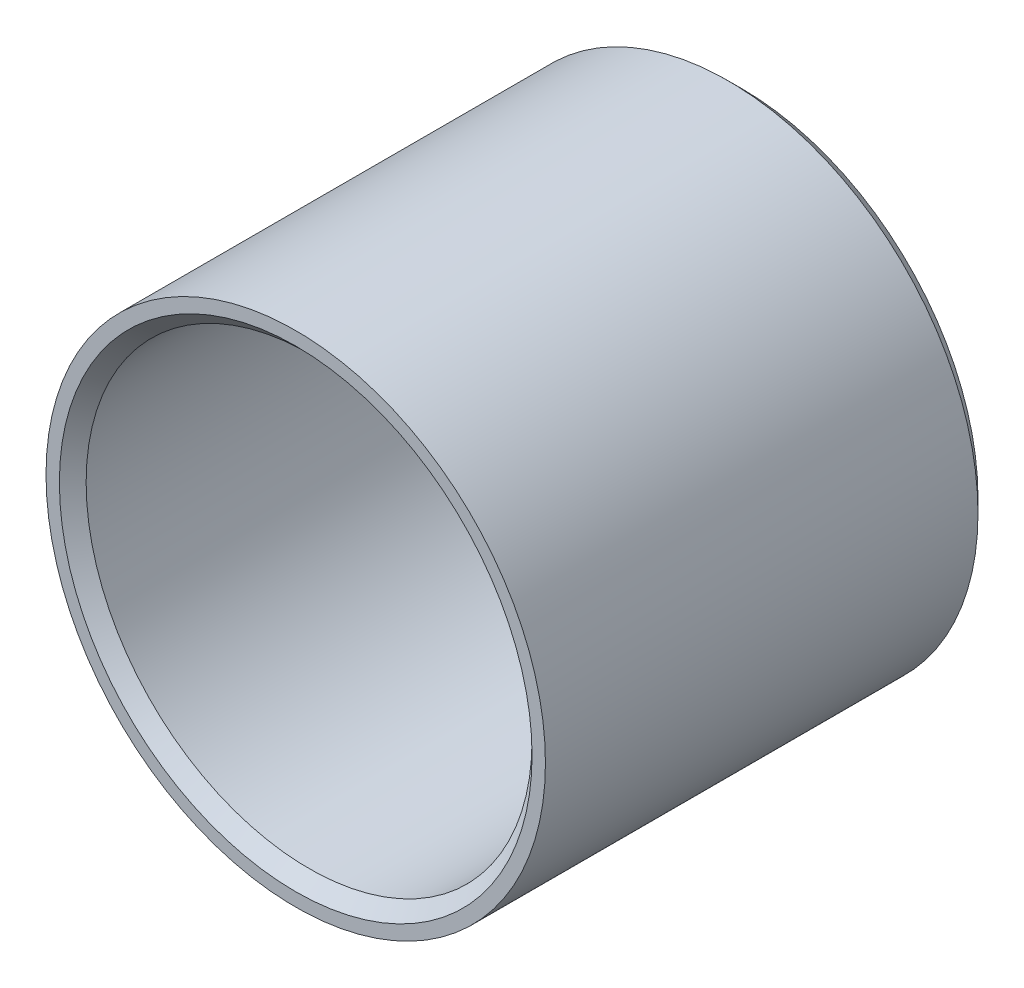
from build123d import *

# Parameters (mm, degrees)
BASE_EXTRUSION_DEPTH      = 12.5
BASE_EXTRUSION_DEPTH_BACK = 12.5
ESQUISSE1_R               = 14
ESQUISSE1_R_2             = 12.5
CHANFREIN1_SIZE           = 0.75


with BuildPart() as part:
    # Esquisse1 → Base-Extrusion (new, two sides: drawn at the far end of the back side and taken through both)
    with BuildSketch(Plane.XY.offset(-BASE_EXTRUSION_DEPTH_BACK)):
        Circle(ESQUISSE1_R)
        Circle(ESQUISSE1_R_2, mode=Mode.SUBTRACT)
    extrude(amount=BASE_EXTRUSION_DEPTH + BASE_EXTRUSION_DEPTH_BACK)

    # Chanfrein1
    chanfrein1_edges = [part.edges().sort_by_distance(p)[0] for p in [
        (-14, 0, -12.5),
        (-12.5, 0, 12.5),
    ]]
    chamfer(chanfrein1_edges, length=CHANFREIN1_SIZE)


solid = part.part
